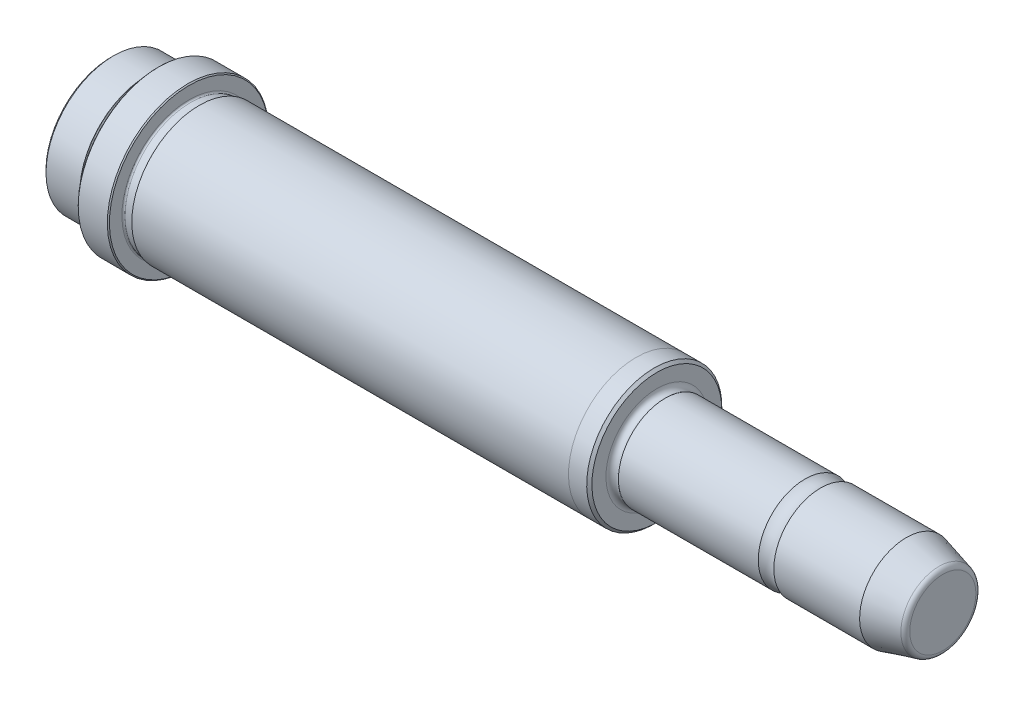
ISO-10303-21;
HEADER;
FILE_DESCRIPTION(('STEP AP214'),'2;1');
FILE_NAME('part.step','',(''),(''),'','','');
FILE_SCHEMA(('AUTOMOTIVE_DESIGN { 1 0 10303 214 1 1 1 1 }'));
ENDSEC;
DATA;
#1=APPLICATION_CONTEXT('core data for automotive mechanical design processes');
#2=APPLICATION_PROTOCOL_DEFINITION('international standard','automotive_design',2000,#1);
#3=PRODUCT_CONTEXT('',#1,'mechanical');
#4=PRODUCT('Part','Part','',(#3));
#5=PRODUCT_RELATED_PRODUCT_CATEGORY('part','',(#4));
#6=PRODUCT_DEFINITION_FORMATION('','',#4);
#7=PRODUCT_DEFINITION_CONTEXT('part definition',#1,'design');
#8=PRODUCT_DEFINITION('design','',#6,#7);
#9=PRODUCT_DEFINITION_SHAPE('','',#8);
#10=(LENGTH_UNIT() NAMED_UNIT(*) SI_UNIT(.MILLI.,.METRE.));
#11=(NAMED_UNIT(*) PLANE_ANGLE_UNIT() SI_UNIT($,.RADIAN.));
#12=(NAMED_UNIT(*) SI_UNIT($,.STERADIAN.) SOLID_ANGLE_UNIT());
#13=UNCERTAINTY_MEASURE_WITH_UNIT(LENGTH_MEASURE(1.E-05),#10,'distance_accuracy_value','');
#14=(GEOMETRIC_REPRESENTATION_CONTEXT(3) GLOBAL_UNCERTAINTY_ASSIGNED_CONTEXT((#13)) GLOBAL_UNIT_ASSIGNED_CONTEXT((#10,
#11,#12)) REPRESENTATION_CONTEXT('',''));
#15=CARTESIAN_POINT('',(0.,0.,0.));
#16=DIRECTION('',(0.,0.,1.));
#17=DIRECTION('',(1.,0.,0.));
#18=AXIS2_PLACEMENT_3D('',#15,#16,#17);
#19=CARTESIAN_POINT('',(55.,0.,0.));
#20=DIRECTION('',(1.,0.,0.));
#21=DIRECTION('',(0.,1.,0.));
#22=AXIS2_PLACEMENT_3D('',#19,#20,#21);
#23=CYLINDRICAL_SURFACE('',#22,8.99999999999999);
#24=CARTESIAN_POINT('',(1.6,0.,0.));
#25=DIRECTION('',(1.,0.,0.));
#26=DIRECTION('',(0.,1.,0.));
#27=AXIS2_PLACEMENT_3D('',#24,#25,#26);
#28=CIRCLE('',#27,9.);
#29=CARTESIAN_POINT('',(1.6,8.99999999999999,0.));
#30=VERTEX_POINT('',#29);
#31=EDGE_CURVE('E105',#30,#30,#28,.T.);
#32=ORIENTED_EDGE('',*,*,#31,.T.);
#33=EDGE_LOOP('',(#32));
#34=FACE_BOUND('',#33,.T.);
#35=CARTESIAN_POINT('',(28.5033370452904,0.,0.));
#36=DIRECTION('',(-1.,0.,0.));
#37=DIRECTION('',(0.,-1.,0.));
#38=AXIS2_PLACEMENT_3D('',#35,#36,#37);
#39=CIRCLE('',#38,9.);
#40=CARTESIAN_POINT('',(28.5033370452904,-8.99999999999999,0.));
#41=VERTEX_POINT('',#40);
#42=EDGE_CURVE('E114',#41,#41,#39,.T.);
#43=ORIENTED_EDGE('',*,*,#42,.T.);
#44=EDGE_LOOP('',(#43));
#45=FACE_BOUND('',#44,.T.);
#46=ADVANCED_FACE('F28',(#34,#45),#23,.T.);
#47=CARTESIAN_POINT('',(-105.,13.,0.));
#48=DIRECTION('',(-1.,0.,0.));
#49=DIRECTION('',(0.,-1.,0.));
#50=AXIS2_PLACEMENT_3D('',#47,#48,#49);
#51=PLANE('',#50);
#52=CARTESIAN_POINT('',(-105.,0.,0.));
#53=DIRECTION('',(-1.,0.,0.));
#54=DIRECTION('',(0.,-1.,0.));
#55=AXIS2_PLACEMENT_3D('',#52,#53,#54);
#56=CIRCLE('',#55,12.5000000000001);
#57=CARTESIAN_POINT('',(-105.,-12.5000000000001,0.));
#58=VERTEX_POINT('',#57);
#59=EDGE_CURVE('E39',#58,#58,#56,.T.);
#60=ORIENTED_EDGE('',*,*,#59,.T.);
#61=EDGE_LOOP('',(#60));
#62=FACE_BOUND('',#61,.T.);
#63=ADVANCED_FACE('F137',(#62),#51,.T.);
#64=CARTESIAN_POINT('',(55.,0.,0.));
#65=DIRECTION('',(1.,0.,0.));
#66=DIRECTION('',(0.,1.,0.));
#67=AXIS2_PLACEMENT_3D('',#64,#65,#66);
#68=CYLINDRICAL_SURFACE('',#67,13.);
#69=CARTESIAN_POINT('',(-104.5,0.,0.));
#70=DIRECTION('',(-1.,0.,0.));
#71=DIRECTION('',(0.,-1.,0.));
#72=AXIS2_PLACEMENT_3D('',#69,#70,#71);
#73=CIRCLE('',#72,13.);
#74=CARTESIAN_POINT('',(-104.5,-13.,0.));
#75=VERTEX_POINT('',#74);
#76=EDGE_CURVE('E43',#75,#75,#73,.F.);
#77=ORIENTED_EDGE('',*,*,#76,.T.);
#78=EDGE_LOOP('',(#77));
#79=FACE_BOUND('',#78,.T.);
#80=CARTESIAN_POINT('',(-98.,0.,0.));
#81=DIRECTION('',(1.,0.,0.));
#82=DIRECTION('',(0.,1.,0.));
#83=AXIS2_PLACEMENT_3D('',#80,#81,#82);
#84=CIRCLE('',#83,13.);
#85=CARTESIAN_POINT('',(-98.,13.,0.));
#86=VERTEX_POINT('',#85);
#87=EDGE_CURVE('E66',#86,#86,#84,.T.);
#88=ORIENTED_EDGE('',*,*,#87,.F.);
#89=EDGE_LOOP('',(#88));
#90=FACE_BOUND('',#89,.T.);
#91=ADVANCED_FACE('F144',(#79,#90),#68,.T.);
#92=CARTESIAN_POINT('',(-98.,12.9,0.));
#93=DIRECTION('',(1.,0.,0.));
#94=DIRECTION('',(0.,1.,0.));
#95=AXIS2_PLACEMENT_3D('',#92,#93,#94);
#96=PLANE('',#95);
#97=ORIENTED_EDGE('',*,*,#87,.T.);
#98=EDGE_LOOP('',(#97));
#99=FACE_BOUND('',#98,.T.);
#100=CARTESIAN_POINT('',(-98.,0.,0.));
#101=DIRECTION('',(1.,0.,0.));
#102=DIRECTION('',(0.,1.,0.));
#103=AXIS2_PLACEMENT_3D('',#100,#101,#102);
#104=CIRCLE('',#103,12.9);
#105=CARTESIAN_POINT('',(-98.,12.9,0.));
#106=VERTEX_POINT('',#105);
#107=EDGE_CURVE('E69',#106,#106,#104,.T.);
#108=ORIENTED_EDGE('',*,*,#107,.F.);
#109=EDGE_LOOP('',(#108));
#110=FACE_BOUND('',#109,.T.);
#111=ADVANCED_FACE('F293',(#99,#110),#96,.T.);
#112=CARTESIAN_POINT('',(-97.7,0.,0.));
#113=DIRECTION('',(1.,0.,0.));
#114=DIRECTION('',(0.,1.,0.));
#115=AXIS2_PLACEMENT_3D('',#112,#113,#114);
#116=TOROIDAL_SURFACE('',#115,12.9,0.299999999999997);
#117=ORIENTED_EDGE('',*,*,#107,.T.);
#118=EDGE_LOOP('',(#117));
#119=FACE_BOUND('',#118,.T.);
#120=CARTESIAN_POINT('',(-97.7,0.,0.));
#121=DIRECTION('',(1.,0.,0.));
#122=DIRECTION('',(0.,1.,0.));
#123=AXIS2_PLACEMENT_3D('',#120,#121,#122);
#124=CIRCLE('',#123,12.6);
#125=CARTESIAN_POINT('',(-97.7,12.6,0.));
#126=VERTEX_POINT('',#125);
#127=EDGE_CURVE('E72',#126,#126,#124,.T.);
#128=ORIENTED_EDGE('',*,*,#127,.F.);
#129=EDGE_LOOP('',(#128));
#130=FACE_BOUND('',#129,.T.);
#131=ADVANCED_FACE('F283',(#119,#130),#116,.F.);
#132=CARTESIAN_POINT('',(55.,0.,0.));
#133=DIRECTION('',(1.,0.,0.));
#134=DIRECTION('',(0.,1.,0.));
#135=AXIS2_PLACEMENT_3D('',#132,#133,#134);
#136=CYLINDRICAL_SURFACE('',#135,12.6);
#137=ORIENTED_EDGE('',*,*,#127,.T.);
#138=EDGE_LOOP('',(#137));
#139=FACE_BOUND('',#138,.T.);
#140=CARTESIAN_POINT('',(-96.3,0.,0.));
#141=DIRECTION('',(1.,0.,0.));
#142=DIRECTION('',(0.,1.,0.));
#143=AXIS2_PLACEMENT_3D('',#140,#141,#142);
#144=CIRCLE('',#143,12.6);
#145=CARTESIAN_POINT('',(-96.3,12.6,0.));
#146=VERTEX_POINT('',#145);
#147=EDGE_CURVE('E75',#146,#146,#144,.T.);
#148=ORIENTED_EDGE('',*,*,#147,.F.);
#149=EDGE_LOOP('',(#148));
#150=FACE_BOUND('',#149,.T.);
#151=ADVANCED_FACE('F271',(#139,#150),#136,.T.);
#152=CARTESIAN_POINT('',(-96.3,0.,0.));
#153=DIRECTION('',(1.,0.,0.));
#154=DIRECTION('',(0.,1.,0.));
#155=AXIS2_PLACEMENT_3D('',#152,#153,#154);
#156=TOROIDAL_SURFACE('',#155,12.9,0.299999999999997);
#157=ORIENTED_EDGE('',*,*,#147,.T.);
#158=EDGE_LOOP('',(#157));
#159=FACE_BOUND('',#158,.T.);
#160=CARTESIAN_POINT('',(-96.,0.,0.));
#161=DIRECTION('',(1.,0.,0.));
#162=DIRECTION('',(0.,1.,0.));
#163=AXIS2_PLACEMENT_3D('',#160,#161,#162);
#164=CIRCLE('',#163,12.9);
#165=CARTESIAN_POINT('',(-96.,12.9,0.));
#166=VERTEX_POINT('',#165);
#167=EDGE_CURVE('E78',#166,#166,#164,.T.);
#168=ORIENTED_EDGE('',*,*,#167,.F.);
#169=EDGE_LOOP('',(#168));
#170=FACE_BOUND('',#169,.T.);
#171=ADVANCED_FACE('F265',(#159,#170),#156,.F.);
#172=CARTESIAN_POINT('',(-96.,15.5,0.));
#173=DIRECTION('',(-1.,0.,0.));
#174=DIRECTION('',(0.,-1.,0.));
#175=AXIS2_PLACEMENT_3D('',#172,#173,#174);
#176=PLANE('',#175);
#177=CARTESIAN_POINT('',(-96.,0.,0.));
#178=DIRECTION('',(-1.,0.,0.));
#179=DIRECTION('',(0.,-1.,0.));
#180=AXIS2_PLACEMENT_3D('',#177,#178,#179);
#181=CIRCLE('',#180,15.3);
#182=CARTESIAN_POINT('',(-96.,-15.3,0.));
#183=VERTEX_POINT('',#182);
#184=EDGE_CURVE('E51',#183,#183,#181,.T.);
#185=ORIENTED_EDGE('',*,*,#184,.T.);
#186=EDGE_LOOP('',(#185));
#187=FACE_BOUND('',#186,.T.);
#188=ORIENTED_EDGE('',*,*,#167,.T.);
#189=EDGE_LOOP('',(#188));
#190=FACE_BOUND('',#189,.T.);
#191=ADVANCED_FACE('F270',(#187,#190),#176,.T.);
#192=CARTESIAN_POINT('',(55.,0.,0.));
#193=DIRECTION('',(1.,0.,0.));
#194=DIRECTION('',(0.,1.,0.));
#195=AXIS2_PLACEMENT_3D('',#192,#193,#194);
#196=CYLINDRICAL_SURFACE('',#195,15.5);
#197=CARTESIAN_POINT('',(-95.8,0.,0.));
#198=DIRECTION('',(-1.,0.,0.));
#199=DIRECTION('',(0.,-1.,0.));
#200=AXIS2_PLACEMENT_3D('',#197,#198,#199);
#201=CIRCLE('',#200,15.5);
#202=CARTESIAN_POINT('',(-95.8,-15.5,0.));
#203=VERTEX_POINT('',#202);
#204=EDGE_CURVE('E54',#203,#203,#201,.F.);
#205=ORIENTED_EDGE('',*,*,#204,.T.);
#206=EDGE_LOOP('',(#205));
#207=FACE_BOUND('',#206,.T.);
#208=CARTESIAN_POINT('',(-90.2000000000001,0.,0.));
#209=DIRECTION('',(1.,0.,0.));
#210=DIRECTION('',(0.,1.,0.));
#211=AXIS2_PLACEMENT_3D('',#208,#209,#210);
#212=CIRCLE('',#211,15.5);
#213=CARTESIAN_POINT('',(-90.2000000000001,15.5,0.));
#214=VERTEX_POINT('',#213);
#215=EDGE_CURVE('E57',#214,#214,#212,.F.);
#216=ORIENTED_EDGE('',*,*,#215,.T.);
#217=EDGE_LOOP('',(#216));
#218=FACE_BOUND('',#217,.T.);
#219=ADVANCED_FACE('F345',(#207,#218),#196,.T.);
#220=CARTESIAN_POINT('',(-90.,12.9,0.));
#221=DIRECTION('',(1.,0.,0.));
#222=DIRECTION('',(0.,1.,0.));
#223=AXIS2_PLACEMENT_3D('',#220,#221,#222);
#224=PLANE('',#223);
#225=CARTESIAN_POINT('',(-90.,0.,0.));
#226=DIRECTION('',(1.,0.,0.));
#227=DIRECTION('',(0.,1.,0.));
#228=AXIS2_PLACEMENT_3D('',#225,#226,#227);
#229=CIRCLE('',#228,15.2999999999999);
#230=CARTESIAN_POINT('',(-90.,15.2999999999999,0.));
#231=VERTEX_POINT('',#230);
#232=EDGE_CURVE('E48',#231,#231,#229,.T.);
#233=ORIENTED_EDGE('',*,*,#232,.T.);
#234=EDGE_LOOP('',(#233));
#235=FACE_BOUND('',#234,.T.);
#236=CARTESIAN_POINT('',(-90.,0.,0.));
#237=DIRECTION('',(1.,0.,0.));
#238=DIRECTION('',(0.,1.,0.));
#239=AXIS2_PLACEMENT_3D('',#236,#237,#238);
#240=CIRCLE('',#239,12.9);
#241=CARTESIAN_POINT('',(-90.,12.9,0.));
#242=VERTEX_POINT('',#241);
#243=EDGE_CURVE('E81',#242,#242,#240,.T.);
#244=ORIENTED_EDGE('',*,*,#243,.F.);
#245=EDGE_LOOP('',(#244));
#246=FACE_BOUND('',#245,.T.);
#247=ADVANCED_FACE('F257',(#235,#246),#224,.T.);
#248=CARTESIAN_POINT('',(-89.7,0.,0.));
#249=DIRECTION('',(1.,0.,0.));
#250=DIRECTION('',(0.,1.,0.));
#251=AXIS2_PLACEMENT_3D('',#248,#249,#250);
#252=TOROIDAL_SURFACE('',#251,12.9,0.299999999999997);
#253=ORIENTED_EDGE('',*,*,#243,.T.);
#254=EDGE_LOOP('',(#253));
#255=FACE_BOUND('',#254,.T.);
#256=CARTESIAN_POINT('',(-89.7,0.,0.));
#257=DIRECTION('',(1.,0.,0.));
#258=DIRECTION('',(0.,1.,0.));
#259=AXIS2_PLACEMENT_3D('',#256,#257,#258);
#260=CIRCLE('',#259,12.6);
#261=CARTESIAN_POINT('',(-89.7,12.6,0.));
#262=VERTEX_POINT('',#261);
#263=EDGE_CURVE('E84',#262,#262,#260,.T.);
#264=ORIENTED_EDGE('',*,*,#263,.F.);
#265=EDGE_LOOP('',(#264));
#266=FACE_BOUND('',#265,.T.);
#267=ADVANCED_FACE('F247',(#255,#266),#252,.F.);
#268=CARTESIAN_POINT('',(55.,0.,0.));
#269=DIRECTION('',(1.,0.,0.));
#270=DIRECTION('',(0.,1.,0.));
#271=AXIS2_PLACEMENT_3D('',#268,#269,#270);
#272=CYLINDRICAL_SURFACE('',#271,12.6);
#273=ORIENTED_EDGE('',*,*,#263,.T.);
#274=EDGE_LOOP('',(#273));
#275=FACE_BOUND('',#274,.T.);
#276=CARTESIAN_POINT('',(-88.3,0.,0.));
#277=DIRECTION('',(1.,0.,0.));
#278=DIRECTION('',(0.,1.,0.));
#279=AXIS2_PLACEMENT_3D('',#276,#277,#278);
#280=CIRCLE('',#279,12.6);
#281=CARTESIAN_POINT('',(-88.3,12.6,0.));
#282=VERTEX_POINT('',#281);
#283=EDGE_CURVE('E87',#282,#282,#280,.T.);
#284=ORIENTED_EDGE('',*,*,#283,.F.);
#285=EDGE_LOOP('',(#284));
#286=FACE_BOUND('',#285,.T.);
#287=ADVANCED_FACE('F237',(#275,#286),#272,.T.);
#288=CARTESIAN_POINT('',(-88.3,0.,0.));
#289=DIRECTION('',(1.,0.,0.));
#290=DIRECTION('',(0.,1.,0.));
#291=AXIS2_PLACEMENT_3D('',#288,#289,#290);
#292=TOROIDAL_SURFACE('',#291,12.9,0.29999999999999);
#293=ORIENTED_EDGE('',*,*,#283,.T.);
#294=EDGE_LOOP('',(#293));
#295=FACE_BOUND('',#294,.T.);
#296=CARTESIAN_POINT('',(-88.,0.,0.));
#297=DIRECTION('',(1.,0.,0.));
#298=DIRECTION('',(0.,1.,0.));
#299=AXIS2_PLACEMENT_3D('',#296,#297,#298);
#300=CIRCLE('',#299,12.9);
#301=CARTESIAN_POINT('',(-88.,12.9,0.));
#302=VERTEX_POINT('',#301);
#303=EDGE_CURVE('E90',#302,#302,#300,.T.);
#304=ORIENTED_EDGE('',*,*,#303,.F.);
#305=EDGE_LOOP('',(#304));
#306=FACE_BOUND('',#305,.T.);
#307=ADVANCED_FACE('F227',(#295,#306),#292,.F.);
#308=CARTESIAN_POINT('',(-88.,13.0001,0.));
#309=DIRECTION('',(-1.,0.,0.));
#310=DIRECTION('',(0.,-1.,0.));
#311=AXIS2_PLACEMENT_3D('',#308,#309,#310);
#312=PLANE('',#311);
#313=ORIENTED_EDGE('',*,*,#303,.T.);
#314=EDGE_LOOP('',(#313));
#315=FACE_BOUND('',#314,.T.);
#316=CARTESIAN_POINT('',(-88.,0.,0.));
#317=DIRECTION('',(1.,0.,0.));
#318=DIRECTION('',(0.,1.,0.));
#319=AXIS2_PLACEMENT_3D('',#316,#317,#318);
#320=CIRCLE('',#319,13.0001);
#321=CARTESIAN_POINT('',(-88.,13.0001,0.));
#322=VERTEX_POINT('',#321);
#323=EDGE_CURVE('E93',#322,#322,#320,.T.);
#324=ORIENTED_EDGE('',*,*,#323,.F.);
#325=EDGE_LOOP('',(#324));
#326=FACE_BOUND('',#325,.T.);
#327=ADVANCED_FACE('F217',(#315,#326),#312,.T.);
#328=CARTESIAN_POINT('',(55.,0.,0.));
#329=DIRECTION('',(1.,0.,0.));
#330=DIRECTION('',(0.,1.,0.));
#331=AXIS2_PLACEMENT_3D('',#328,#329,#330);
#332=CYLINDRICAL_SURFACE('',#331,13.0001);
#333=ORIENTED_EDGE('',*,*,#323,.T.);
#334=EDGE_LOOP('',(#333));
#335=FACE_BOUND('',#334,.T.);
#336=CARTESIAN_POINT('',(-4.,0.,0.));
#337=DIRECTION('',(1.,0.,0.));
#338=DIRECTION('',(0.,1.,0.));
#339=AXIS2_PLACEMENT_3D('',#336,#337,#338);
#340=CIRCLE('',#339,13.0001);
#341=CARTESIAN_POINT('',(-4.,13.0001,0.));
#342=VERTEX_POINT('',#341);
#343=EDGE_CURVE('E96',#342,#342,#340,.T.);
#344=ORIENTED_EDGE('',*,*,#343,.F.);
#345=EDGE_LOOP('',(#344));
#346=FACE_BOUND('',#345,.T.);
#347=ADVANCED_FACE('F205',(#335,#346),#332,.T.);
#348=CARTESIAN_POINT('',(-4.,13.0001,0.));
#349=DIRECTION('',(1.,0.,0.));
#350=DIRECTION('',(0.,1.,0.));
#351=AXIS2_PLACEMENT_3D('',#348,#349,#350);
#352=PLANE('',#351);
#353=ORIENTED_EDGE('',*,*,#343,.T.);
#354=EDGE_LOOP('',(#353));
#355=FACE_BOUND('',#354,.T.);
#356=CARTESIAN_POINT('',(-4.,0.,0.));
#357=DIRECTION('',(1.,0.,0.));
#358=DIRECTION('',(0.,1.,0.));
#359=AXIS2_PLACEMENT_3D('',#356,#357,#358);
#360=CIRCLE('',#359,13.);
#361=CARTESIAN_POINT('',(-4.,13.,0.));
#362=VERTEX_POINT('',#361);
#363=EDGE_CURVE('E99',#362,#362,#360,.T.);
#364=ORIENTED_EDGE('',*,*,#363,.F.);
#365=EDGE_LOOP('',(#364));
#366=FACE_BOUND('',#365,.T.);
#367=ADVANCED_FACE('F199',(#355,#366),#352,.T.);
#368=CARTESIAN_POINT('',(55.,0.,0.));
#369=DIRECTION('',(1.,0.,0.));
#370=DIRECTION('',(0.,1.,0.));
#371=AXIS2_PLACEMENT_3D('',#368,#369,#370);
#372=CYLINDRICAL_SURFACE('',#371,13.);
#373=CARTESIAN_POINT('',(-0.500000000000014,0.,0.));
#374=DIRECTION('',(1.,0.,0.));
#375=DIRECTION('',(0.,1.,0.));
#376=AXIS2_PLACEMENT_3D('',#373,#374,#375);
#377=CIRCLE('',#376,13.);
#378=CARTESIAN_POINT('',(-0.500000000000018,13.,0.));
#379=VERTEX_POINT('',#378);
#380=EDGE_CURVE('E10',#379,#379,#377,.F.);
#381=ORIENTED_EDGE('',*,*,#380,.T.);
#382=EDGE_LOOP('',(#381));
#383=FACE_BOUND('',#382,.T.);
#384=ORIENTED_EDGE('',*,*,#363,.T.);
#385=EDGE_LOOP('',(#384));
#386=FACE_BOUND('',#385,.T.);
#387=ADVANCED_FACE('F204',(#383,#386),#372,.T.);
#388=CARTESIAN_POINT('',(0.,9.79999999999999,0.));
#389=DIRECTION('',(1.,0.,0.));
#390=DIRECTION('',(0.,1.,0.));
#391=AXIS2_PLACEMENT_3D('',#388,#389,#390);
#392=PLANE('',#391);
#393=CARTESIAN_POINT('',(0.,0.,0.));
#394=DIRECTION('',(1.,0.,0.));
#395=DIRECTION('',(0.,1.,0.));
#396=AXIS2_PLACEMENT_3D('',#393,#394,#395);
#397=CIRCLE('',#396,12.5);
#398=CARTESIAN_POINT('',(0.,12.5,0.));
#399=VERTEX_POINT('',#398);
#400=EDGE_CURVE('E35',#399,#399,#397,.T.);
#401=ORIENTED_EDGE('',*,*,#400,.T.);
#402=EDGE_LOOP('',(#401));
#403=FACE_BOUND('',#402,.T.);
#404=CARTESIAN_POINT('',(0.,0.,0.));
#405=DIRECTION('',(1.,0.,0.));
#406=DIRECTION('',(0.,1.,0.));
#407=AXIS2_PLACEMENT_3D('',#404,#405,#406);
#408=CIRCLE('',#407,9.8);
#409=CARTESIAN_POINT('',(0.,9.79999999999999,0.));
#410=VERTEX_POINT('',#409);
#411=EDGE_CURVE('E102',#410,#410,#408,.T.);
#412=ORIENTED_EDGE('',*,*,#411,.F.);
#413=EDGE_LOOP('',(#412));
#414=FACE_BOUND('',#413,.T.);
#415=ADVANCED_FACE('F132',(#403,#414),#392,.T.);
#416=CARTESIAN_POINT('',(1.,0.,0.));
#417=DIRECTION('',(1.,0.,0.));
#418=DIRECTION('',(0.,1.,0.));
#419=AXIS2_PLACEMENT_3D('',#416,#417,#418);
#420=TOROIDAL_SURFACE('',#419,9.8,1.);
#421=ORIENTED_EDGE('',*,*,#411,.T.);
#422=EDGE_LOOP('',(#421));
#423=FACE_BOUND('',#422,.T.);
#424=ORIENTED_EDGE('',*,*,#31,.F.);
#425=EDGE_LOOP('',(#424));
#426=FACE_BOUND('',#425,.T.);
#427=ADVANCED_FACE('F122',(#423,#426),#420,.F.);
#428=CARTESIAN_POINT('',(30.,0.,0.));
#429=DIRECTION('',(-1.,0.,0.));
#430=DIRECTION('',(0.,-1.,0.));
#431=AXIS2_PLACEMENT_3D('',#428,#429,#430);
#432=TOROIDAL_SURFACE('',#431,11.6,3.);
#433=CARTESIAN_POINT('',(31.4966629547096,0.,0.));
#434=DIRECTION('',(-1.,0.,0.));
#435=DIRECTION('',(0.,-1.,0.));
#436=AXIS2_PLACEMENT_3D('',#433,#434,#435);
#437=CIRCLE('',#436,9.);
#438=CARTESIAN_POINT('',(31.4966629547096,-8.99999999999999,0.));
#439=VERTEX_POINT('',#438);
#440=EDGE_CURVE('E111',#439,#439,#437,.T.);
#441=ORIENTED_EDGE('',*,*,#440,.T.);
#442=EDGE_LOOP('',(#441));
#443=FACE_BOUND('',#442,.T.);
#444=ORIENTED_EDGE('',*,*,#42,.F.);
#445=EDGE_LOOP('',(#444));
#446=FACE_BOUND('',#445,.T.);
#447=ADVANCED_FACE('F119',(#443,#446),#432,.F.);
#448=CARTESIAN_POINT('',(55.,7.12435565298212,0.));
#449=DIRECTION('',(1.,0.,0.));
#450=DIRECTION('',(0.,1.,0.));
#451=AXIS2_PLACEMENT_3D('',#448,#449,#450);
#452=PLANE('',#451);
#453=CARTESIAN_POINT('',(55.,0.,0.));
#454=DIRECTION('',(1.,0.,0.));
#455=DIRECTION('',(0.,1.,0.));
#456=AXIS2_PLACEMENT_3D('',#453,#454,#455);
#457=CIRCLE('',#456,6.35702866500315);
#458=CARTESIAN_POINT('',(55.,6.35702866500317,0.));
#459=VERTEX_POINT('',#458);
#460=EDGE_CURVE('E63',#459,#459,#457,.T.);
#461=ORIENTED_EDGE('',*,*,#460,.T.);
#462=EDGE_LOOP('',(#461));
#463=FACE_BOUND('',#462,.T.);
#464=ADVANCED_FACE('F121',(#463),#452,.T.);
#465=CARTESIAN_POINT('',(55.,0.,0.));
#466=DIRECTION('',(-1.,0.,0.));
#467=DIRECTION('',(0.,-1.,0.));
#468=AXIS2_PLACEMENT_3D('',#465,#466,#467);
#469=CONICAL_SURFACE('',#468,7.12435565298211,0.26179938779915);
#470=CARTESIAN_POINT('',(54.2588190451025,0.,0.));
#471=DIRECTION('',(1.,0.,0.));
#472=DIRECTION('',(0.,1.,0.));
#473=AXIS2_PLACEMENT_3D('',#470,#471,#472);
#474=CIRCLE('',#473,7.32295449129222);
#475=CARTESIAN_POINT('',(54.2588190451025,7.32295449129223,0.));
#476=VERTEX_POINT('',#475);
#477=EDGE_CURVE('E60',#476,#476,#474,.F.);
#478=ORIENTED_EDGE('',*,*,#477,.T.);
#479=EDGE_LOOP('',(#478));
#480=FACE_BOUND('',#479,.T.);
#481=CARTESIAN_POINT('',(48.,0.,0.));
#482=DIRECTION('',(1.,0.,0.));
#483=DIRECTION('',(0.,1.,0.));
#484=AXIS2_PLACEMENT_3D('',#481,#482,#483);
#485=CIRCLE('',#484,8.99999999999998);
#486=CARTESIAN_POINT('',(48.,8.99999999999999,0.));
#487=VERTEX_POINT('',#486);
#488=EDGE_CURVE('E108',#487,#487,#485,.T.);
#489=ORIENTED_EDGE('',*,*,#488,.T.);
#490=EDGE_LOOP('',(#489));
#491=FACE_BOUND('',#490,.T.);
#492=ADVANCED_FACE('F129',(#480,#491),#469,.T.);
#493=ORIENTED_EDGE('',*,*,#488,.F.);
#494=EDGE_LOOP('',(#493));
#495=FACE_BOUND('',#494,.T.);
#496=ORIENTED_EDGE('',*,*,#440,.F.);
#497=EDGE_LOOP('',(#496));
#498=FACE_BOUND('',#497,.T.);
#499=ADVANCED_FACE('F140',(#495,#498),#23,.T.);
#500=CARTESIAN_POINT('',(54.,0.,0.));
#501=DIRECTION('',(1.,0.,0.));
#502=DIRECTION('',(0.,1.,0.));
#503=AXIS2_PLACEMENT_3D('',#500,#501,#502);
#504=TOROIDAL_SURFACE('',#503,6.35702866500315,1.);
#505=ORIENTED_EDGE('',*,*,#477,.F.);
#506=EDGE_LOOP('',(#505));
#507=FACE_BOUND('',#506,.T.);
#508=ORIENTED_EDGE('',*,*,#460,.F.);
#509=EDGE_LOOP('',(#508));
#510=FACE_BOUND('',#509,.T.);
#511=ADVANCED_FACE('F148',(#507,#510),#504,.T.);
#512=CARTESIAN_POINT('',(-95.8,0.,0.));
#513=DIRECTION('',(1.,0.,0.));
#514=DIRECTION('',(0.,1.,0.));
#515=AXIS2_PLACEMENT_3D('',#512,#513,#514);
#516=CONICAL_SURFACE('',#515,15.5,0.785398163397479);
#517=ORIENTED_EDGE('',*,*,#184,.F.);
#518=EDGE_LOOP('',(#517));
#519=FACE_BOUND('',#518,.T.);
#520=ORIENTED_EDGE('',*,*,#204,.F.);
#521=EDGE_LOOP('',(#520));
#522=FACE_BOUND('',#521,.T.);
#523=ADVANCED_FACE('F154',(#519,#522),#516,.T.);
#524=CARTESIAN_POINT('',(-90.,0.,0.));
#525=DIRECTION('',(-1.,0.,0.));
#526=DIRECTION('',(0.,-1.,0.));
#527=AXIS2_PLACEMENT_3D('',#524,#525,#526);
#528=CONICAL_SURFACE('',#527,15.2999999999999,0.785398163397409);
#529=ORIENTED_EDGE('',*,*,#215,.F.);
#530=EDGE_LOOP('',(#529));
#531=FACE_BOUND('',#530,.T.);
#532=ORIENTED_EDGE('',*,*,#232,.F.);
#533=EDGE_LOOP('',(#532));
#534=FACE_BOUND('',#533,.T.);
#535=ADVANCED_FACE('F321',(#531,#534),#528,.T.);
#536=CARTESIAN_POINT('',(-104.5,0.,0.));
#537=DIRECTION('',(1.,0.,0.));
#538=DIRECTION('',(0.,1.,0.));
#539=AXIS2_PLACEMENT_3D('',#536,#537,#538);
#540=CONICAL_SURFACE('',#539,13.,0.785398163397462);
#541=ORIENTED_EDGE('',*,*,#59,.F.);
#542=EDGE_LOOP('',(#541));
#543=FACE_BOUND('',#542,.T.);
#544=ORIENTED_EDGE('',*,*,#76,.F.);
#545=EDGE_LOOP('',(#544));
#546=FACE_BOUND('',#545,.T.);
#547=ADVANCED_FACE('F326',(#543,#546),#540,.T.);
#548=CARTESIAN_POINT('',(0.,0.,0.));
#549=DIRECTION('',(-1.,0.,0.));
#550=DIRECTION('',(0.,-1.,0.));
#551=AXIS2_PLACEMENT_3D('',#548,#549,#550);
#552=CONICAL_SURFACE('',#551,12.5,0.785398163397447);
#553=ORIENTED_EDGE('',*,*,#380,.F.);
#554=EDGE_LOOP('',(#553));
#555=FACE_BOUND('',#554,.T.);
#556=ORIENTED_EDGE('',*,*,#400,.F.);
#557=EDGE_LOOP('',(#556));
#558=FACE_BOUND('',#557,.T.);
#559=ADVANCED_FACE('F30',(#555,#558),#552,.T.);
#560=CLOSED_SHELL('',(#46,#63,#91,#111,#131,#151,#171,#191,#219,#247,#267,#287,#307,#327,#347,
#367,#387,#415,#427,#447,#464,#492,#499,#511,#523,#535,#547,#559));
#561=MANIFOLD_SOLID_BREP('B2',#560);
#562=ADVANCED_BREP_SHAPE_REPRESENTATION('',(#18,#561),#14);
#563=SHAPE_DEFINITION_REPRESENTATION(#9,#562);
ENDSEC;
END-ISO-10303-21;
